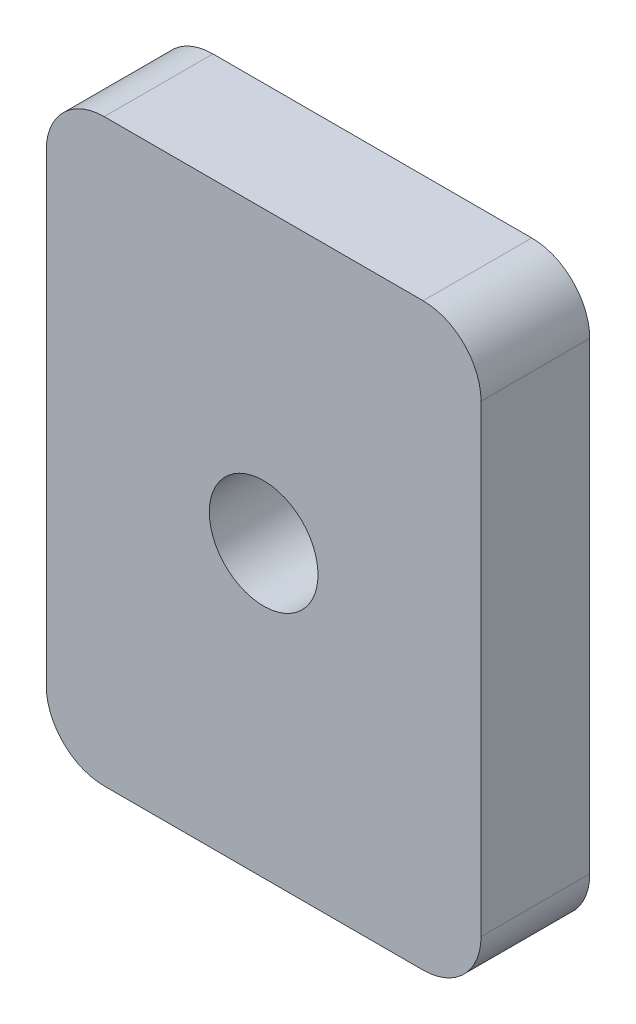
from build123d import *

# Parameters (mm, degrees)
SKETCH1_W           = 19.05
SKETCH1_H           = 25.4
SKETCH1_R           = 2.38125
BOSS_EXTRUDE1_DEPTH = 4.7625
FILLET1_R           = 2.54


with BuildPart() as part:
    # Sketch1 → Boss-Extrude1 (new body)
    with BuildSketch(Plane.XY):
        with Locations((9.525, 12.7)):
            Rectangle(SKETCH1_W, SKETCH1_H)
        with Locations(Location((9.525, 12.7, 0), (0, 0, 180))):
            Circle(SKETCH1_R, mode=Mode.SUBTRACT)
    extrude(amount=BOSS_EXTRUDE1_DEPTH)

    # Fillet1
    fillet1_edges = [part.edges().sort_by_distance(p)[0] for p in [
        (0, 25.4, 2.38125),
        (19.05, 25.4, 2.38125),
        (19.05, 0, 2.38125),
        (0, 0, 2.38125),
    ]]
    fillet(fillet1_edges, radius=FILLET1_R)


solid = part.part
